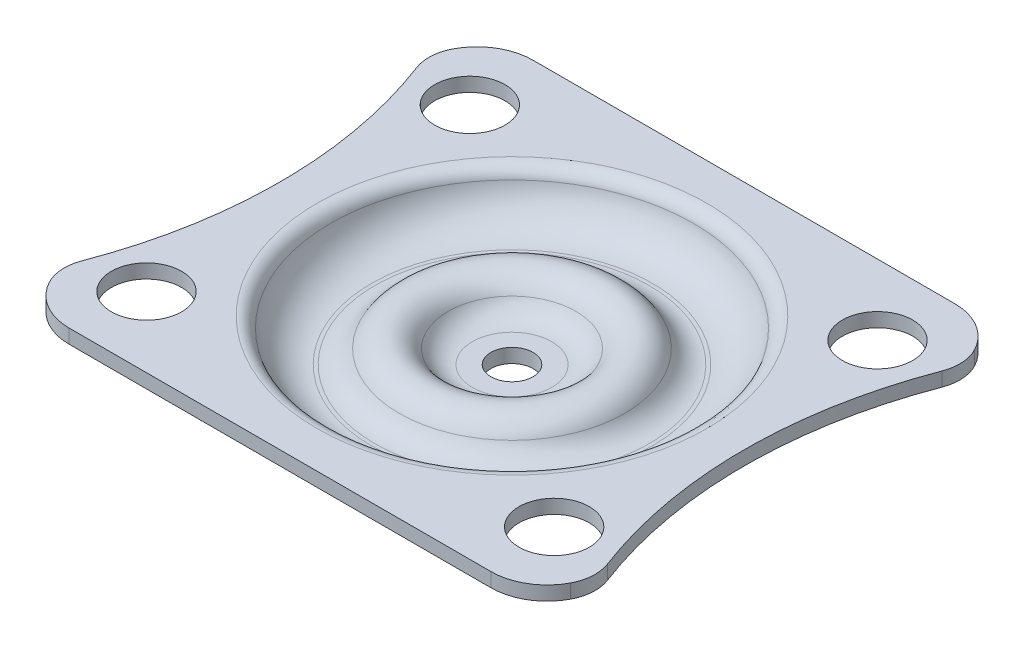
from build123d import *

# Parameters (mm, degrees)
ESQUISSE2_R        = 15
ESQUISSE2_R_2      = 2.5
BOSS_EXTRU_1_DEPTH = 1


with BuildPart() as part:
    # Esquisse1 → R_vol.-Mince1 (revolve)
    with BuildSketch(Plane.XY, mode=Mode.PRIVATE) as r_vol_mince1_sk:
        with BuildLine():
            Line((-15, 0), (-13.872983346, 0))
            ThreePointArc((-13.872983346, 0), (-13.260610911, -0.209430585), (-12.90473751, -0.75))
            ThreePointArc((-12.90473751, -0.75), (-11.837117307, -2.371708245), (-10, -3))
            Line((-10, -3), (-9.75, -3))
            ThreePointArc((-9.75, -3), (-8.75, -2.732050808), (-8.017949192, -2))
            ThreePointArc((-8.017949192, -2), (-6.285898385, -1), (-4.553847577, -2))
            ThreePointArc((-4.553847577, -2), (-3.82179677, -2.732050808), (-2.82179677, -3))
            Line((-2.82179677, -3), (-1.5, -3))
            Line((-1.5, -3), (-1.5, -4))
            Line((-1.5, -4), (-2.82179677, -4))
            ThreePointArc((-2.82179677, -4), (-4.32179677, -3.598076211), (-5.419872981, -2.5))
            ThreePointArc((-5.419872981, -2.5), (-6.285898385, -2), (-7.151923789, -2.5))
            ThreePointArc((-7.151923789, -2.5), (-8.25, -3.598076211), (-9.75, -4))
            Line((-9.75, -4), (-10, -4))
            ThreePointArc((-10, -4), (-12.449489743, -3.16227766), (-13.872983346, -1))
            Line((-13.872983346, -1), (-15, -1))
            Line((-15, -1), (-15, 0))
        make_face()
    revolve(r_vol_mince1_sk.sketch.rotate(Axis((0, 5.373737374, 0), (0, -1, 0)), 270), axis=Axis((0, 5.373737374, 0), (0, -1, 0)))

    # Esquisse2 → Boss.-Extru.1 (add)
    with BuildSketch(Plane(origin=(0, 0, 0), x_dir=(1, 0, 0), z_dir=(0, 1, 0))):
        with BuildLine():
            Line((-15, 16.5), (15, 16.5))
            ThreePointArc((15, 16.5), (17.057983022, 15.929971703), (18.529411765, 14.382352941))
            ThreePointArc((18.529411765, 14.382352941), (18.87633895, 13.160450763), (18.68654311, 11.90451249))
            ThreePointArc((18.68654311, 11.90451249), (16.5, 0), (18.68654311, -11.90451249))
            ThreePointArc((18.68654311, -11.90451249), (18.87633895, -13.160450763), (18.529411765, -14.382352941))
            ThreePointArc((18.529411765, -14.382352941), (17.057983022, -15.929971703), (15, -16.5))
            Line((15, -16.5), (-15, -16.5))
            ThreePointArc((-15, -16.5), (-17.057983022, -15.929971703), (-18.529411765, -14.382352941))
            ThreePointArc((-18.529411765, -14.382352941), (-18.87633895, -13.160450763), (-18.68654311, -11.90451249))
            ThreePointArc((-18.68654311, -11.90451249), (-16.5, 0), (-18.68654311, 11.90451249))
            ThreePointArc((-18.68654311, 11.90451249), (-18.87633895, 13.160450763), (-18.529411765, 14.382352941))
            ThreePointArc((-18.529411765, 14.382352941), (-17.057983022, 15.929971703), (-15, 16.5))
        make_face()
        Circle(ESQUISSE2_R, mode=Mode.SUBTRACT)
        with Locations(Location((-14.5, 11.5, 0), (0, 0, 270))):
            Circle(ESQUISSE2_R_2, mode=Mode.SUBTRACT)
        with Locations(Location((-14.5, -11.5, 0), (0, 0, 90))):
            Circle(ESQUISSE2_R_2, mode=Mode.SUBTRACT)
        with Locations(Location((14.5, 11.5, 0), (0, 0, 90))):
            Circle(ESQUISSE2_R_2, mode=Mode.SUBTRACT)
        with Locations(Location((14.5, -11.5, 0), (0, 0, 270))):
            Circle(ESQUISSE2_R_2, mode=Mode.SUBTRACT)
    extrude(amount=-BOSS_EXTRU_1_DEPTH)


solid = part.part
